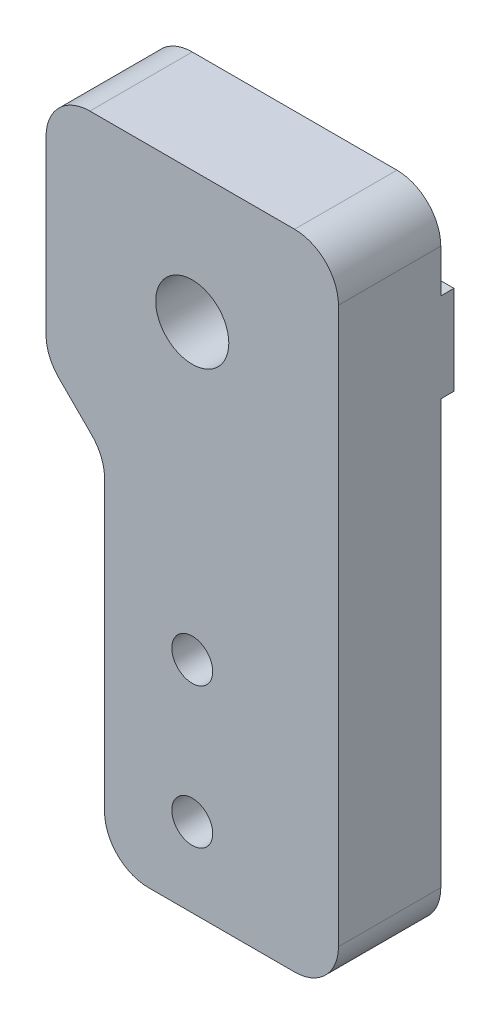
ISO-10303-21;
HEADER;
FILE_DESCRIPTION(('STEP AP214'),'2;1');
FILE_NAME('part.step','',(''),(''),'','','');
FILE_SCHEMA(('AUTOMOTIVE_DESIGN { 1 0 10303 214 1 1 1 1 }'));
ENDSEC;
DATA;
#1=APPLICATION_CONTEXT('core data for automotive mechanical design processes');
#2=APPLICATION_PROTOCOL_DEFINITION('international standard','automotive_design',2000,#1);
#3=PRODUCT_CONTEXT('',#1,'mechanical');
#4=PRODUCT('Part','Part','',(#3));
#5=PRODUCT_RELATED_PRODUCT_CATEGORY('part','',(#4));
#6=PRODUCT_DEFINITION_FORMATION('','',#4);
#7=PRODUCT_DEFINITION_CONTEXT('part definition',#1,'design');
#8=PRODUCT_DEFINITION('design','',#6,#7);
#9=PRODUCT_DEFINITION_SHAPE('','',#8);
#10=(LENGTH_UNIT() NAMED_UNIT(*) SI_UNIT(.MILLI.,.METRE.));
#11=(NAMED_UNIT(*) PLANE_ANGLE_UNIT() SI_UNIT($,.RADIAN.));
#12=(NAMED_UNIT(*) SI_UNIT($,.STERADIAN.) SOLID_ANGLE_UNIT());
#13=UNCERTAINTY_MEASURE_WITH_UNIT(LENGTH_MEASURE(1.E-05),#10,'distance_accuracy_value','');
#14=(GEOMETRIC_REPRESENTATION_CONTEXT(3) GLOBAL_UNCERTAINTY_ASSIGNED_CONTEXT((#13)) GLOBAL_UNIT_ASSIGNED_CONTEXT((#10,
#11,#12)) REPRESENTATION_CONTEXT('',''));
#15=CARTESIAN_POINT('',(0.,0.,0.));
#16=DIRECTION('',(0.,0.,1.));
#17=DIRECTION('',(1.,0.,0.));
#18=AXIS2_PLACEMENT_3D('',#15,#16,#17);
#19=CARTESIAN_POINT('',(17.,41.,0.));
#20=DIRECTION('',(0.,0.,1.));
#21=DIRECTION('',(1.,0.,0.));
#22=AXIS2_PLACEMENT_3D('',#19,#20,#21);
#23=PLANE('',#22);
#24=DIRECTION('',(1.,0.,0.));
#25=VECTOR('',#24,1.);
#26=CARTESIAN_POINT('',(-6.16603600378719,38.05,0.));
#27=LINE('',#26,#25);
#28=CARTESIAN_POINT('',(0.,38.05,0.));
#29=VERTEX_POINT('',#28);
#30=CARTESIAN_POINT('',(20.,38.05,0.));
#31=VERTEX_POINT('',#30);
#32=EDGE_CURVE('E241',#29,#31,#27,.T.);
#33=ORIENTED_EDGE('',*,*,#32,.F.);
#34=DIRECTION('',(0.,-1.,0.));
#35=VECTOR('',#34,1.);
#36=CARTESIAN_POINT('',(0.,41.,0.));
#37=LINE('',#36,#35);
#38=CARTESIAN_POINT('',(0.,41.,0.));
#39=VERTEX_POINT('',#38);
#40=EDGE_CURVE('E307',#39,#29,#37,.T.);
#41=ORIENTED_EDGE('',*,*,#40,.F.);
#42=CARTESIAN_POINT('',(3.,41.,0.));
#43=DIRECTION('',(0.,0.,1.));
#44=DIRECTION('',(1.,0.,0.));
#45=AXIS2_PLACEMENT_3D('',#42,#43,#44);
#46=CIRCLE('',#45,3.);
#47=CARTESIAN_POINT('',(3.00000000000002,44.,0.));
#48=VERTEX_POINT('',#47);
#49=EDGE_CURVE('E301',#48,#39,#46,.T.);
#50=ORIENTED_EDGE('',*,*,#49,.F.);
#51=DIRECTION('',(-1.,0.,0.));
#52=VECTOR('',#51,1.);
#53=CARTESIAN_POINT('',(17.,44.,0.));
#54=LINE('',#53,#52);
#55=CARTESIAN_POINT('',(17.,44.,0.));
#56=VERTEX_POINT('',#55);
#57=EDGE_CURVE('E299',#56,#48,#54,.T.);
#58=ORIENTED_EDGE('',*,*,#57,.F.);
#59=CARTESIAN_POINT('',(17.,41.,0.));
#60=DIRECTION('',(0.,0.,1.));
#61=DIRECTION('',(1.,0.,0.));
#62=AXIS2_PLACEMENT_3D('',#59,#60,#61);
#63=CIRCLE('',#62,3.);
#64=CARTESIAN_POINT('',(20.,41.,0.));
#65=VERTEX_POINT('',#64);
#66=EDGE_CURVE('E280',#65,#56,#63,.T.);
#67=ORIENTED_EDGE('',*,*,#66,.F.);
#68=DIRECTION('',(0.,1.,0.));
#69=VECTOR('',#68,1.);
#70=CARTESIAN_POINT('',(20.,3.00000000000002,0.));
#71=LINE('',#70,#69);
#72=EDGE_CURVE('E310',#31,#65,#71,.T.);
#73=ORIENTED_EDGE('',*,*,#72,.F.);
#74=EDGE_LOOP('',(#33,#41,#50,#58,#67,#73));
#75=FACE_BOUND('',#74,.T.);
#76=ADVANCED_FACE('F33',(#75),#23,.F.);
#77=CARTESIAN_POINT('',(17.,41.,7.));
#78=DIRECTION('',(0.,0.,1.));
#79=DIRECTION('',(1.,0.,0.));
#80=AXIS2_PLACEMENT_3D('',#77,#78,#79);
#81=PLANE('',#80);
#82=DIRECTION('',(0.,-1.,0.));
#83=VECTOR('',#82,1.);
#84=CARTESIAN_POINT('',(0.,41.,7.));
#85=LINE('',#84,#83);
#86=CARTESIAN_POINT('',(0.,41.,7.));
#87=VERTEX_POINT('',#86);
#88=CARTESIAN_POINT('',(0.,29.2426406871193,7.));
#89=VERTEX_POINT('',#88);
#90=EDGE_CURVE('E288',#87,#89,#85,.T.);
#91=ORIENTED_EDGE('',*,*,#90,.T.);
#92=CARTESIAN_POINT('',(3.,29.2426406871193,7.));
#93=DIRECTION('',(0.,0.,1.));
#94=DIRECTION('',(1.,0.,0.));
#95=AXIS2_PLACEMENT_3D('',#92,#93,#94);
#96=CIRCLE('',#95,3.);
#97=CARTESIAN_POINT('',(0.878679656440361,27.1213203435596,7.));
#98=VERTEX_POINT('',#97);
#99=EDGE_CURVE('E192',#89,#98,#96,.T.);
#100=ORIENTED_EDGE('',*,*,#99,.T.);
#101=DIRECTION('',(-0.707106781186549,0.707106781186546,0.));
#102=VECTOR('',#101,1.);
#103=CARTESIAN_POINT('',(0.,28.,7.));
#104=LINE('',#103,#102);
#105=CARTESIAN_POINT('',(3.12132034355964,24.8786796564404,7.));
#106=VERTEX_POINT('',#105);
#107=EDGE_CURVE('E216',#106,#98,#104,.T.);
#108=ORIENTED_EDGE('',*,*,#107,.F.);
#109=CARTESIAN_POINT('',(1.,22.7573593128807,7.));
#110=DIRECTION('',(0.,0.,1.));
#111=DIRECTION('',(1.,0.,0.));
#112=AXIS2_PLACEMENT_3D('',#109,#110,#111);
#113=CIRCLE('',#112,3.);
#114=CARTESIAN_POINT('',(4.,22.7573593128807,7.));
#115=VERTEX_POINT('',#114);
#116=EDGE_CURVE('E41',#106,#115,#113,.F.);
#117=ORIENTED_EDGE('',*,*,#116,.T.);
#118=DIRECTION('',(0.,1.,0.));
#119=VECTOR('',#118,1.);
#120=CARTESIAN_POINT('',(4.,24.,7.));
#121=LINE('',#120,#119);
#122=CARTESIAN_POINT('',(4.00000000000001,3.,7.));
#123=VERTEX_POINT('',#122);
#124=EDGE_CURVE('E214',#123,#115,#121,.T.);
#125=ORIENTED_EDGE('',*,*,#124,.F.);
#126=CARTESIAN_POINT('',(7.00000000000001,3.,7.));
#127=DIRECTION('',(0.,0.,1.));
#128=DIRECTION('',(1.,0.,0.));
#129=AXIS2_PLACEMENT_3D('',#126,#127,#128);
#130=CIRCLE('',#129,3.);
#131=CARTESIAN_POINT('',(7.00000000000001,0.,7.));
#132=VERTEX_POINT('',#131);
#133=EDGE_CURVE('E189',#123,#132,#130,.T.);
#134=ORIENTED_EDGE('',*,*,#133,.T.);
#135=DIRECTION('',(1.,0.,0.));
#136=VECTOR('',#135,1.);
#137=CARTESIAN_POINT('',(3.00000000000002,0.,7.));
#138=LINE('',#137,#136);
#139=CARTESIAN_POINT('',(17.,0.,7.));
#140=VERTEX_POINT('',#139);
#141=EDGE_CURVE('E290',#132,#140,#138,.T.);
#142=ORIENTED_EDGE('',*,*,#141,.T.);
#143=CARTESIAN_POINT('',(17.,3.,7.));
#144=DIRECTION('',(0.,0.,1.));
#145=DIRECTION('',(1.,0.,0.));
#146=AXIS2_PLACEMENT_3D('',#143,#144,#145);
#147=CIRCLE('',#146,3.);
#148=CARTESIAN_POINT('',(20.,3.00000000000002,7.));
#149=VERTEX_POINT('',#148);
#150=EDGE_CURVE('E292',#140,#149,#147,.T.);
#151=ORIENTED_EDGE('',*,*,#150,.T.);
#152=DIRECTION('',(0.,1.,0.));
#153=VECTOR('',#152,1.);
#154=CARTESIAN_POINT('',(20.,3.00000000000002,7.));
#155=LINE('',#154,#153);
#156=CARTESIAN_POINT('',(20.,41.,7.));
#157=VERTEX_POINT('',#156);
#158=EDGE_CURVE('E294',#149,#157,#155,.T.);
#159=ORIENTED_EDGE('',*,*,#158,.T.);
#160=CARTESIAN_POINT('',(17.,41.,7.));
#161=DIRECTION('',(0.,0.,1.));
#162=DIRECTION('',(1.,0.,0.));
#163=AXIS2_PLACEMENT_3D('',#160,#161,#162);
#164=CIRCLE('',#163,3.);
#165=CARTESIAN_POINT('',(17.,44.,7.));
#166=VERTEX_POINT('',#165);
#167=EDGE_CURVE('E281',#157,#166,#164,.T.);
#168=ORIENTED_EDGE('',*,*,#167,.T.);
#169=DIRECTION('',(-1.,0.,0.));
#170=VECTOR('',#169,1.);
#171=CARTESIAN_POINT('',(17.,44.,7.));
#172=LINE('',#171,#170);
#173=CARTESIAN_POINT('',(3.00000000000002,44.,7.));
#174=VERTEX_POINT('',#173);
#175=EDGE_CURVE('E284',#166,#174,#172,.T.);
#176=ORIENTED_EDGE('',*,*,#175,.T.);
#177=CARTESIAN_POINT('',(3.,41.,7.));
#178=DIRECTION('',(0.,0.,1.));
#179=DIRECTION('',(1.,0.,0.));
#180=AXIS2_PLACEMENT_3D('',#177,#178,#179);
#181=CIRCLE('',#180,3.);
#182=EDGE_CURVE('E286',#174,#87,#181,.T.);
#183=ORIENTED_EDGE('',*,*,#182,.T.);
#184=EDGE_LOOP('',(#91,#100,#108,#117,#125,#134,#142,#151,#159,#168,#176,#183));
#185=FACE_BOUND('',#184,.T.);
#186=CARTESIAN_POINT('',(10.,5.4,7.));
#187=DIRECTION('',(0.,0.,1.));
#188=DIRECTION('',(1.,0.,0.));
#189=AXIS2_PLACEMENT_3D('',#186,#187,#188);
#190=CIRCLE('',#189,1.4);
#191=CARTESIAN_POINT('',(11.4,5.4,7.));
#192=VERTEX_POINT('',#191);
#193=EDGE_CURVE('E272',#192,#192,#190,.T.);
#194=ORIENTED_EDGE('',*,*,#193,.F.);
#195=EDGE_LOOP('',(#194));
#196=FACE_BOUND('',#195,.T.);
#197=CARTESIAN_POINT('',(10.,35.,7.));
#198=DIRECTION('',(0.,0.,1.));
#199=DIRECTION('',(1.,0.,0.));
#200=AXIS2_PLACEMENT_3D('',#197,#198,#199);
#201=CIRCLE('',#200,2.5);
#202=CARTESIAN_POINT('',(12.5,35.,7.));
#203=VERTEX_POINT('',#202);
#204=EDGE_CURVE('E275',#203,#203,#201,.T.);
#205=ORIENTED_EDGE('',*,*,#204,.F.);
#206=EDGE_LOOP('',(#205));
#207=FACE_BOUND('',#206,.T.);
#208=CARTESIAN_POINT('',(10.,15.,7.));
#209=DIRECTION('',(0.,0.,1.));
#210=DIRECTION('',(1.,0.,0.));
#211=AXIS2_PLACEMENT_3D('',#208,#209,#210);
#212=CIRCLE('',#211,1.4);
#213=CARTESIAN_POINT('',(11.4,15.,7.));
#214=VERTEX_POINT('',#213);
#215=EDGE_CURVE('E264',#214,#214,#212,.T.);
#216=ORIENTED_EDGE('',*,*,#215,.F.);
#217=EDGE_LOOP('',(#216));
#218=FACE_BOUND('',#217,.T.);
#219=ADVANCED_FACE('F212',(#185,#196,#207,#218),#81,.T.);
#220=DIRECTION('',(0.707106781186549,-0.707106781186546,0.));
#221=VECTOR('',#220,1.);
#222=CARTESIAN_POINT('',(0.,28.,0.));
#223=LINE('',#222,#221);
#224=CARTESIAN_POINT('',(0.878679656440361,27.1213203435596,0.));
#225=VERTEX_POINT('',#224);
#226=CARTESIAN_POINT('',(3.12132034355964,24.8786796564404,0.));
#227=VERTEX_POINT('',#226);
#228=EDGE_CURVE('E178',#225,#227,#223,.T.);
#229=ORIENTED_EDGE('',*,*,#228,.F.);
#230=CARTESIAN_POINT('',(3.,29.2426406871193,0.));
#231=DIRECTION('',(0.,0.,1.));
#232=DIRECTION('',(1.,0.,0.));
#233=AXIS2_PLACEMENT_3D('',#230,#231,#232);
#234=CIRCLE('',#233,3.);
#235=CARTESIAN_POINT('',(0.,29.2426406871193,0.));
#236=VERTEX_POINT('',#235);
#237=EDGE_CURVE('E200',#225,#236,#234,.F.);
#238=ORIENTED_EDGE('',*,*,#237,.T.);
#239=CARTESIAN_POINT('',(0.,31.95,0.));
#240=VERTEX_POINT('',#239);
#241=EDGE_CURVE('E249',#240,#236,#37,.T.);
#242=ORIENTED_EDGE('',*,*,#241,.F.);
#243=DIRECTION('',(1.,0.,0.));
#244=VECTOR('',#243,1.);
#245=CARTESIAN_POINT('',(-6.16603600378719,31.95,0.));
#246=LINE('',#245,#244);
#247=CARTESIAN_POINT('',(20.,31.95,0.));
#248=VERTEX_POINT('',#247);
#249=EDGE_CURVE('E159',#240,#248,#246,.T.);
#250=ORIENTED_EDGE('',*,*,#249,.T.);
#251=CARTESIAN_POINT('',(20.,3.00000000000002,0.));
#252=VERTEX_POINT('',#251);
#253=EDGE_CURVE('E174',#252,#248,#71,.T.);
#254=ORIENTED_EDGE('',*,*,#253,.F.);
#255=CARTESIAN_POINT('',(17.,3.,0.));
#256=DIRECTION('',(0.,0.,1.));
#257=DIRECTION('',(1.,0.,0.));
#258=AXIS2_PLACEMENT_3D('',#255,#256,#257);
#259=CIRCLE('',#258,3.);
#260=CARTESIAN_POINT('',(17.,0.,0.));
#261=VERTEX_POINT('',#260);
#262=EDGE_CURVE('E313',#261,#252,#259,.T.);
#263=ORIENTED_EDGE('',*,*,#262,.F.);
#264=DIRECTION('',(1.,0.,0.));
#265=VECTOR('',#264,1.);
#266=CARTESIAN_POINT('',(3.00000000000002,0.,0.));
#267=LINE('',#266,#265);
#268=CARTESIAN_POINT('',(7.00000000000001,0.,0.));
#269=VERTEX_POINT('',#268);
#270=EDGE_CURVE('E304',#269,#261,#267,.T.);
#271=ORIENTED_EDGE('',*,*,#270,.F.);
#272=CARTESIAN_POINT('',(7.00000000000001,3.,0.));
#273=DIRECTION('',(0.,0.,1.));
#274=DIRECTION('',(1.,0.,0.));
#275=AXIS2_PLACEMENT_3D('',#272,#273,#274);
#276=CIRCLE('',#275,3.);
#277=CARTESIAN_POINT('',(4.00000000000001,3.,0.));
#278=VERTEX_POINT('',#277);
#279=EDGE_CURVE('E55',#269,#278,#276,.F.);
#280=ORIENTED_EDGE('',*,*,#279,.T.);
#281=DIRECTION('',(0.,-1.,0.));
#282=VECTOR('',#281,1.);
#283=CARTESIAN_POINT('',(4.,24.,0.));
#284=LINE('',#283,#282);
#285=CARTESIAN_POINT('',(4.,22.7573593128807,0.));
#286=VERTEX_POINT('',#285);
#287=EDGE_CURVE('E231',#286,#278,#284,.T.);
#288=ORIENTED_EDGE('',*,*,#287,.F.);
#289=CARTESIAN_POINT('',(1.,22.7573593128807,0.));
#290=DIRECTION('',(0.,0.,1.));
#291=DIRECTION('',(1.,0.,0.));
#292=AXIS2_PLACEMENT_3D('',#289,#290,#291);
#293=CIRCLE('',#292,3.);
#294=EDGE_CURVE('E11',#286,#227,#293,.T.);
#295=ORIENTED_EDGE('',*,*,#294,.T.);
#296=EDGE_LOOP('',(#229,#238,#242,#250,#254,#263,#271,#280,#288,#295));
#297=FACE_BOUND('',#296,.T.);
#298=CARTESIAN_POINT('',(10.,5.4,0.));
#299=DIRECTION('',(0.,0.,1.));
#300=DIRECTION('',(1.,0.,0.));
#301=AXIS2_PLACEMENT_3D('',#298,#299,#300);
#302=CIRCLE('',#301,1.4);
#303=CARTESIAN_POINT('',(11.4,5.4,0.));
#304=VERTEX_POINT('',#303);
#305=EDGE_CURVE('E269',#304,#304,#302,.T.);
#306=ORIENTED_EDGE('',*,*,#305,.T.);
#307=EDGE_LOOP('',(#306));
#308=FACE_BOUND('',#307,.T.);
#309=CARTESIAN_POINT('',(10.,15.,0.));
#310=DIRECTION('',(0.,0.,1.));
#311=DIRECTION('',(1.,0.,0.));
#312=AXIS2_PLACEMENT_3D('',#309,#310,#311);
#313=CIRCLE('',#312,1.4);
#314=CARTESIAN_POINT('',(11.4,15.,0.));
#315=VERTEX_POINT('',#314);
#316=EDGE_CURVE('E259',#315,#315,#313,.T.);
#317=ORIENTED_EDGE('',*,*,#316,.T.);
#318=EDGE_LOOP('',(#317));
#319=FACE_BOUND('',#318,.T.);
#320=ADVANCED_FACE('F228',(#297,#308,#319),#23,.F.);
#321=CARTESIAN_POINT('',(17.,41.,7.));
#322=DIRECTION('',(0.,0.,-1.));
#323=DIRECTION('',(-1.,0.,0.));
#324=AXIS2_PLACEMENT_3D('',#321,#322,#323);
#325=CYLINDRICAL_SURFACE('',#324,3.);
#326=ORIENTED_EDGE('',*,*,#66,.T.);
#327=DIRECTION('',(0.,0.,-1.));
#328=VECTOR('',#327,1.);
#329=CARTESIAN_POINT('',(17.,44.,7.));
#330=LINE('',#329,#328);
#331=EDGE_CURVE('E190',#166,#56,#330,.T.);
#332=ORIENTED_EDGE('',*,*,#331,.F.);
#333=ORIENTED_EDGE('',*,*,#167,.F.);
#334=DIRECTION('',(0.,0.,-1.));
#335=VECTOR('',#334,1.);
#336=CARTESIAN_POINT('',(20.,41.,7.));
#337=LINE('',#336,#335);
#338=EDGE_CURVE('E296',#157,#65,#337,.T.);
#339=ORIENTED_EDGE('',*,*,#338,.T.);
#340=EDGE_LOOP('',(#326,#332,#333,#339));
#341=FACE_BOUND('',#340,.T.);
#342=ADVANCED_FACE('F338',(#341),#325,.T.);
#343=CARTESIAN_POINT('',(17.,44.,7.));
#344=DIRECTION('',(0.,-1.,0.));
#345=DIRECTION('',(0.,0.,-1.));
#346=AXIS2_PLACEMENT_3D('',#343,#344,#345);
#347=PLANE('',#346);
#348=ORIENTED_EDGE('',*,*,#57,.T.);
#349=DIRECTION('',(0.,0.,-1.));
#350=VECTOR('',#349,1.);
#351=CARTESIAN_POINT('',(3.00000000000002,44.,7.));
#352=LINE('',#351,#350);
#353=EDGE_CURVE('E328',#174,#48,#352,.T.);
#354=ORIENTED_EDGE('',*,*,#353,.F.);
#355=ORIENTED_EDGE('',*,*,#175,.F.);
#356=ORIENTED_EDGE('',*,*,#331,.T.);
#357=EDGE_LOOP('',(#348,#354,#355,#356));
#358=FACE_BOUND('',#357,.T.);
#359=ADVANCED_FACE('F333',(#358),#347,.F.);
#360=CARTESIAN_POINT('',(3.,41.,7.));
#361=DIRECTION('',(0.,0.,-1.));
#362=DIRECTION('',(-1.,0.,0.));
#363=AXIS2_PLACEMENT_3D('',#360,#361,#362);
#364=CYLINDRICAL_SURFACE('',#363,3.);
#365=ORIENTED_EDGE('',*,*,#49,.T.);
#366=DIRECTION('',(0.,0.,-1.));
#367=VECTOR('',#366,1.);
#368=CARTESIAN_POINT('',(0.,41.,7.));
#369=LINE('',#368,#367);
#370=EDGE_CURVE('E325',#87,#39,#369,.T.);
#371=ORIENTED_EDGE('',*,*,#370,.F.);
#372=ORIENTED_EDGE('',*,*,#182,.F.);
#373=ORIENTED_EDGE('',*,*,#353,.T.);
#374=EDGE_LOOP('',(#365,#371,#372,#373));
#375=FACE_BOUND('',#374,.T.);
#376=ADVANCED_FACE('F345',(#375),#364,.T.);
#377=CARTESIAN_POINT('',(0.,41.,7.));
#378=DIRECTION('',(1.,0.,0.));
#379=DIRECTION('',(0.,0.,-1.));
#380=AXIS2_PLACEMENT_3D('',#377,#378,#379);
#381=PLANE('',#380);
#382=ORIENTED_EDGE('',*,*,#241,.T.);
#383=DIRECTION('',(0.,0.,1.));
#384=VECTOR('',#383,1.);
#385=CARTESIAN_POINT('',(0.,29.2426406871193,7.));
#386=LINE('',#385,#384);
#387=EDGE_CURVE('E186',#236,#89,#386,.T.);
#388=ORIENTED_EDGE('',*,*,#387,.T.);
#389=ORIENTED_EDGE('',*,*,#90,.F.);
#390=ORIENTED_EDGE('',*,*,#370,.T.);
#391=ORIENTED_EDGE('',*,*,#40,.T.);
#392=DIRECTION('',(0.,0.,1.));
#393=VECTOR('',#392,1.);
#394=CARTESIAN_POINT('',(0.,38.05,0.));
#395=LINE('',#394,#393);
#396=CARTESIAN_POINT('',(0.,38.05,-0.900000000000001));
#397=VERTEX_POINT('',#396);
#398=EDGE_CURVE('E240',#397,#29,#395,.T.);
#399=ORIENTED_EDGE('',*,*,#398,.F.);
#400=DIRECTION('',(0.,1.,0.));
#401=VECTOR('',#400,1.);
#402=CARTESIAN_POINT('',(0.,38.05,-0.900000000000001));
#403=LINE('',#402,#401);
#404=CARTESIAN_POINT('',(0.,31.95,-0.900000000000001));
#405=VERTEX_POINT('',#404);
#406=EDGE_CURVE('E239',#405,#397,#403,.T.);
#407=ORIENTED_EDGE('',*,*,#406,.F.);
#408=DIRECTION('',(0.,0.,1.));
#409=VECTOR('',#408,1.);
#410=CARTESIAN_POINT('',(0.,31.95,0.));
#411=LINE('',#410,#409);
#412=EDGE_CURVE('E155',#405,#240,#411,.T.);
#413=ORIENTED_EDGE('',*,*,#412,.T.);
#414=EDGE_LOOP('',(#382,#388,#389,#390,#391,#399,#407,#413));
#415=FACE_BOUND('',#414,.T.);
#416=ADVANCED_FACE('F348',(#415),#381,.F.);
#417=CARTESIAN_POINT('',(3.00000000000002,0.,7.));
#418=DIRECTION('',(0.,1.,0.));
#419=DIRECTION('',(0.,0.,1.));
#420=AXIS2_PLACEMENT_3D('',#417,#418,#419);
#421=PLANE('',#420);
#422=ORIENTED_EDGE('',*,*,#141,.F.);
#423=DIRECTION('',(0.,0.,1.));
#424=VECTOR('',#423,1.);
#425=CARTESIAN_POINT('',(7.00000000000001,0.,7.));
#426=LINE('',#425,#424);
#427=EDGE_CURVE('E48',#132,#269,#426,.F.);
#428=ORIENTED_EDGE('',*,*,#427,.T.);
#429=ORIENTED_EDGE('',*,*,#270,.T.);
#430=DIRECTION('',(0.,0.,-1.));
#431=VECTOR('',#430,1.);
#432=CARTESIAN_POINT('',(17.,0.,7.));
#433=LINE('',#432,#431);
#434=EDGE_CURVE('E322',#140,#261,#433,.T.);
#435=ORIENTED_EDGE('',*,*,#434,.F.);
#436=EDGE_LOOP('',(#422,#428,#429,#435));
#437=FACE_BOUND('',#436,.T.);
#438=ADVANCED_FACE('F394',(#437),#421,.F.);
#439=CARTESIAN_POINT('',(17.,3.,7.));
#440=DIRECTION('',(0.,0.,-1.));
#441=DIRECTION('',(-1.,0.,0.));
#442=AXIS2_PLACEMENT_3D('',#439,#440,#441);
#443=CYLINDRICAL_SURFACE('',#442,3.);
#444=ORIENTED_EDGE('',*,*,#262,.T.);
#445=DIRECTION('',(0.,0.,-1.));
#446=VECTOR('',#445,1.);
#447=CARTESIAN_POINT('',(20.,3.00000000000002,7.));
#448=LINE('',#447,#446);
#449=EDGE_CURVE('E320',#149,#252,#448,.T.);
#450=ORIENTED_EDGE('',*,*,#449,.F.);
#451=ORIENTED_EDGE('',*,*,#150,.F.);
#452=ORIENTED_EDGE('',*,*,#434,.T.);
#453=EDGE_LOOP('',(#444,#450,#451,#452));
#454=FACE_BOUND('',#453,.T.);
#455=ADVANCED_FACE('F397',(#454),#443,.T.);
#456=CARTESIAN_POINT('',(20.,3.00000000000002,7.));
#457=DIRECTION('',(-1.,0.,0.));
#458=DIRECTION('',(0.,0.,1.));
#459=AXIS2_PLACEMENT_3D('',#456,#457,#458);
#460=PLANE('',#459);
#461=ORIENTED_EDGE('',*,*,#253,.T.);
#462=DIRECTION('',(0.,0.,-1.));
#463=VECTOR('',#462,1.);
#464=CARTESIAN_POINT('',(20.,31.95,0.));
#465=LINE('',#464,#463);
#466=CARTESIAN_POINT('',(20.,31.95,-0.900000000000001));
#467=VERTEX_POINT('',#466);
#468=EDGE_CURVE('E153',#248,#467,#465,.T.);
#469=ORIENTED_EDGE('',*,*,#468,.T.);
#470=DIRECTION('',(0.,-1.,0.));
#471=VECTOR('',#470,1.);
#472=CARTESIAN_POINT('',(20.,38.05,-0.900000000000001));
#473=LINE('',#472,#471);
#474=CARTESIAN_POINT('',(20.,38.05,-0.900000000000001));
#475=VERTEX_POINT('',#474);
#476=EDGE_CURVE('E162',#475,#467,#473,.T.);
#477=ORIENTED_EDGE('',*,*,#476,.F.);
#478=DIRECTION('',(0.,0.,-1.));
#479=VECTOR('',#478,1.);
#480=CARTESIAN_POINT('',(20.,38.05,0.));
#481=LINE('',#480,#479);
#482=EDGE_CURVE('E168',#31,#475,#481,.T.);
#483=ORIENTED_EDGE('',*,*,#482,.F.);
#484=ORIENTED_EDGE('',*,*,#72,.T.);
#485=ORIENTED_EDGE('',*,*,#338,.F.);
#486=ORIENTED_EDGE('',*,*,#158,.F.);
#487=ORIENTED_EDGE('',*,*,#449,.T.);
#488=EDGE_LOOP('',(#461,#469,#477,#483,#484,#485,#486,#487));
#489=FACE_BOUND('',#488,.T.);
#490=ADVANCED_FACE('F171',(#489),#460,.F.);
#491=CARTESIAN_POINT('',(10.,35.,7.));
#492=DIRECTION('',(0.,0.,-1.));
#493=DIRECTION('',(-1.,0.,0.));
#494=AXIS2_PLACEMENT_3D('',#491,#492,#493);
#495=CYLINDRICAL_SURFACE('',#494,2.5);
#496=ORIENTED_EDGE('',*,*,#204,.T.);
#497=EDGE_LOOP('',(#496));
#498=FACE_BOUND('',#497,.T.);
#499=CARTESIAN_POINT('',(10.,35.,-0.900000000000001));
#500=DIRECTION('',(0.,0.,1.));
#501=DIRECTION('',(1.,0.,0.));
#502=AXIS2_PLACEMENT_3D('',#499,#500,#501);
#503=CIRCLE('',#502,2.5);
#504=CARTESIAN_POINT('',(12.5,35.,-0.900000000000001));
#505=VERTEX_POINT('',#504);
#506=EDGE_CURVE('E175',#505,#505,#503,.F.);
#507=ORIENTED_EDGE('',*,*,#506,.T.);
#508=EDGE_LOOP('',(#507));
#509=FACE_BOUND('',#508,.T.);
#510=ADVANCED_FACE('F404',(#498,#509),#495,.F.);
#511=CARTESIAN_POINT('',(10.,5.4,7.));
#512=DIRECTION('',(0.,0.,-1.));
#513=DIRECTION('',(-1.,0.,0.));
#514=AXIS2_PLACEMENT_3D('',#511,#512,#513);
#515=CYLINDRICAL_SURFACE('',#514,1.4);
#516=ORIENTED_EDGE('',*,*,#193,.T.);
#517=EDGE_LOOP('',(#516));
#518=FACE_BOUND('',#517,.T.);
#519=ORIENTED_EDGE('',*,*,#305,.F.);
#520=EDGE_LOOP('',(#519));
#521=FACE_BOUND('',#520,.T.);
#522=ADVANCED_FACE('F461',(#518,#521),#515,.F.);
#523=CARTESIAN_POINT('',(10.,15.,7.));
#524=DIRECTION('',(0.,0.,-1.));
#525=DIRECTION('',(-1.,0.,0.));
#526=AXIS2_PLACEMENT_3D('',#523,#524,#525);
#527=CYLINDRICAL_SURFACE('',#526,1.4);
#528=ORIENTED_EDGE('',*,*,#215,.T.);
#529=EDGE_LOOP('',(#528));
#530=FACE_BOUND('',#529,.T.);
#531=ORIENTED_EDGE('',*,*,#316,.F.);
#532=EDGE_LOOP('',(#531));
#533=FACE_BOUND('',#532,.T.);
#534=ADVANCED_FACE('F484',(#530,#533),#527,.F.);
#535=CARTESIAN_POINT('',(-6.16603600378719,31.95,0.));
#536=DIRECTION('',(0.,-1.,0.));
#537=DIRECTION('',(0.,0.,-1.));
#538=AXIS2_PLACEMENT_3D('',#535,#536,#537);
#539=PLANE('',#538);
#540=ORIENTED_EDGE('',*,*,#412,.F.);
#541=DIRECTION('',(1.,0.,0.));
#542=VECTOR('',#541,1.);
#543=CARTESIAN_POINT('',(-6.16603600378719,31.95,-0.900000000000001));
#544=LINE('',#543,#542);
#545=EDGE_CURVE('E148',#405,#467,#544,.T.);
#546=ORIENTED_EDGE('',*,*,#545,.T.);
#547=ORIENTED_EDGE('',*,*,#468,.F.);
#548=ORIENTED_EDGE('',*,*,#249,.F.);
#549=EDGE_LOOP('',(#540,#546,#547,#548));
#550=FACE_BOUND('',#549,.T.);
#551=ADVANCED_FACE('F150',(#550),#539,.T.);
#552=CARTESIAN_POINT('',(-6.16603600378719,38.05,-0.900000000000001));
#553=DIRECTION('',(0.,0.,1.));
#554=DIRECTION('',(1.,0.,0.));
#555=AXIS2_PLACEMENT_3D('',#552,#553,#554);
#556=PLANE('',#555);
#557=ORIENTED_EDGE('',*,*,#506,.F.);
#558=EDGE_LOOP('',(#557));
#559=FACE_BOUND('',#558,.T.);
#560=ORIENTED_EDGE('',*,*,#545,.F.);
#561=ORIENTED_EDGE('',*,*,#406,.T.);
#562=DIRECTION('',(1.,0.,0.));
#563=VECTOR('',#562,1.);
#564=CARTESIAN_POINT('',(-6.16603600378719,38.05,-0.900000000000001));
#565=LINE('',#564,#563);
#566=EDGE_CURVE('E158',#397,#475,#565,.T.);
#567=ORIENTED_EDGE('',*,*,#566,.T.);
#568=ORIENTED_EDGE('',*,*,#476,.T.);
#569=EDGE_LOOP('',(#560,#561,#567,#568));
#570=FACE_BOUND('',#569,.T.);
#571=ADVANCED_FACE('F163',(#559,#570),#556,.F.);
#572=CARTESIAN_POINT('',(-6.16603600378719,38.05,0.));
#573=DIRECTION('',(0.,-1.,0.));
#574=DIRECTION('',(0.,0.,-1.));
#575=AXIS2_PLACEMENT_3D('',#572,#573,#574);
#576=PLANE('',#575);
#577=ORIENTED_EDGE('',*,*,#566,.F.);
#578=ORIENTED_EDGE('',*,*,#398,.T.);
#579=ORIENTED_EDGE('',*,*,#32,.T.);
#580=ORIENTED_EDGE('',*,*,#482,.T.);
#581=EDGE_LOOP('',(#577,#578,#579,#580));
#582=FACE_BOUND('',#581,.T.);
#583=ADVANCED_FACE('F354',(#582),#576,.F.);
#584=CARTESIAN_POINT('',(0.,28.,-28.2842712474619));
#585=DIRECTION('',(0.707106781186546,0.707106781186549,0.));
#586=DIRECTION('',(-0.707106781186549,0.707106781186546,0.));
#587=AXIS2_PLACEMENT_3D('',#584,#585,#586);
#588=PLANE('',#587);
#589=ORIENTED_EDGE('',*,*,#107,.T.);
#590=DIRECTION('',(0.,0.,1.));
#591=VECTOR('',#590,1.);
#592=CARTESIAN_POINT('',(0.878679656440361,27.1213203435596,-28.2842712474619));
#593=LINE('',#592,#591);
#594=EDGE_CURVE('E197',#98,#225,#593,.F.);
#595=ORIENTED_EDGE('',*,*,#594,.T.);
#596=ORIENTED_EDGE('',*,*,#228,.T.);
#597=DIRECTION('',(0.,0.,1.));
#598=VECTOR('',#597,1.);
#599=CARTESIAN_POINT('',(3.12132034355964,24.8786796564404,7.));
#600=LINE('',#599,#598);
#601=EDGE_CURVE('E194',#227,#106,#600,.T.);
#602=ORIENTED_EDGE('',*,*,#601,.T.);
#603=EDGE_LOOP('',(#589,#595,#596,#602));
#604=FACE_BOUND('',#603,.T.);
#605=ADVANCED_FACE('F233',(#604),#588,.F.);
#606=CARTESIAN_POINT('',(4.,24.,-28.2842712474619));
#607=DIRECTION('',(1.,0.,0.));
#608=DIRECTION('',(0.,1.,0.));
#609=AXIS2_PLACEMENT_3D('',#606,#607,#608);
#610=PLANE('',#609);
#611=ORIENTED_EDGE('',*,*,#124,.T.);
#612=DIRECTION('',(0.,0.,1.));
#613=VECTOR('',#612,1.);
#614=CARTESIAN_POINT('',(4.,22.7573593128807,0.));
#615=LINE('',#614,#613);
#616=EDGE_CURVE('E205',#115,#286,#615,.F.);
#617=ORIENTED_EDGE('',*,*,#616,.T.);
#618=ORIENTED_EDGE('',*,*,#287,.T.);
#619=DIRECTION('',(0.,0.,1.));
#620=VECTOR('',#619,1.);
#621=CARTESIAN_POINT('',(4.00000000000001,3.,-28.2842712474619));
#622=LINE('',#621,#620);
#623=EDGE_CURVE('E202',#278,#123,#622,.T.);
#624=ORIENTED_EDGE('',*,*,#623,.T.);
#625=EDGE_LOOP('',(#611,#617,#618,#624));
#626=FACE_BOUND('',#625,.T.);
#627=ADVANCED_FACE('F221',(#626),#610,.F.);
#628=CARTESIAN_POINT('',(3.,29.2426406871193,7.));
#629=DIRECTION('',(0.,0.,1.));
#630=DIRECTION('',(1.,0.,0.));
#631=AXIS2_PLACEMENT_3D('',#628,#629,#630);
#632=CYLINDRICAL_SURFACE('',#631,3.);
#633=ORIENTED_EDGE('',*,*,#237,.F.);
#634=ORIENTED_EDGE('',*,*,#594,.F.);
#635=ORIENTED_EDGE('',*,*,#99,.F.);
#636=ORIENTED_EDGE('',*,*,#387,.F.);
#637=EDGE_LOOP('',(#633,#634,#635,#636));
#638=FACE_BOUND('',#637,.T.);
#639=ADVANCED_FACE('F383',(#638),#632,.T.);
#640=CARTESIAN_POINT('',(1.,22.7573593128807,-28.2842712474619));
#641=DIRECTION('',(0.,0.,-1.));
#642=DIRECTION('',(-1.,0.,0.));
#643=AXIS2_PLACEMENT_3D('',#640,#641,#642);
#644=CYLINDRICAL_SURFACE('',#643,3.);
#645=ORIENTED_EDGE('',*,*,#294,.F.);
#646=ORIENTED_EDGE('',*,*,#616,.F.);
#647=ORIENTED_EDGE('',*,*,#116,.F.);
#648=ORIENTED_EDGE('',*,*,#601,.F.);
#649=EDGE_LOOP('',(#645,#646,#647,#648));
#650=FACE_BOUND('',#649,.T.);
#651=ADVANCED_FACE('F225',(#650),#644,.F.);
#652=CARTESIAN_POINT('',(7.00000000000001,3.,-28.2842712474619));
#653=DIRECTION('',(0.,0.,1.));
#654=DIRECTION('',(1.,0.,0.));
#655=AXIS2_PLACEMENT_3D('',#652,#653,#654);
#656=CYLINDRICAL_SURFACE('',#655,3.);
#657=ORIENTED_EDGE('',*,*,#279,.F.);
#658=ORIENTED_EDGE('',*,*,#427,.F.);
#659=ORIENTED_EDGE('',*,*,#133,.F.);
#660=ORIENTED_EDGE('',*,*,#623,.F.);
#661=EDGE_LOOP('',(#657,#658,#659,#660));
#662=FACE_BOUND('',#661,.T.);
#663=ADVANCED_FACE('F35',(#662),#656,.T.);
#664=CLOSED_SHELL('',(#76,#219,#320,#342,#359,#376,#416,#438,#455,#490,#510,#522,#534,#551,#571,
#583,#605,#627,#639,#651,#663));
#665=MANIFOLD_SOLID_BREP('B2',#664);
#666=ADVANCED_BREP_SHAPE_REPRESENTATION('',(#18,#665),#14);
#667=SHAPE_DEFINITION_REPRESENTATION(#9,#666);
ENDSEC;
END-ISO-10303-21;
